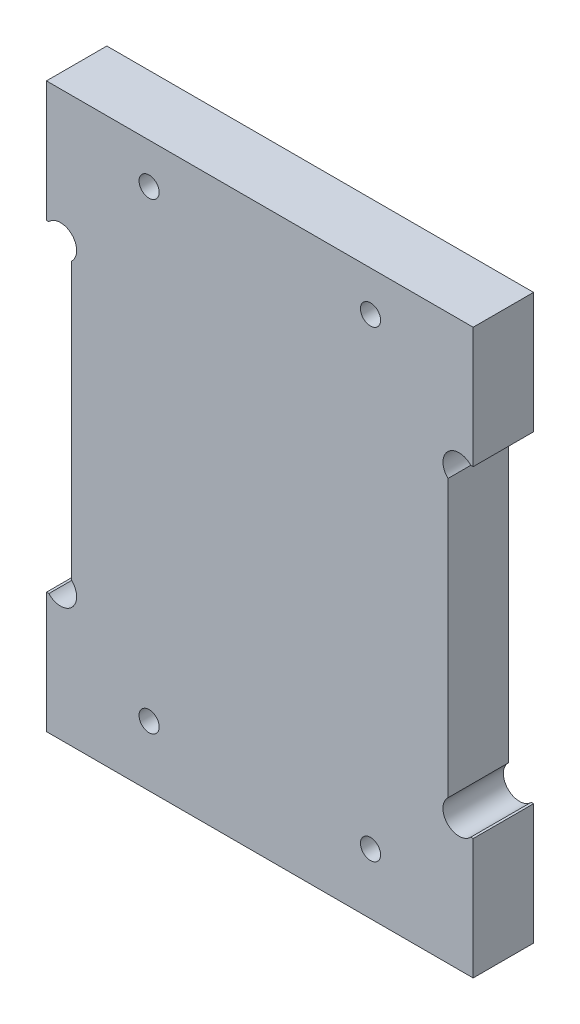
from build123d import *

# Parameters (mm, degrees)
ESQUISSE1_R             = 1
BOSS_EXTRU_1_DEPTH      = 6
ESQUISSE2_W             = 38.444349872
ESQUISSE2_H             = 80.070301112
ESQUISSE2_W_2           = 28.899545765
ESQUISSE2_H_2           = 80.070301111
ENL_V_MAT_EXTRU_1_DEPTH = 10


with BuildPart() as part:
    # Esquisse1 → Boss.-Extru.1 (new body)
    with BuildSketch(Plane.XY):
        with BuildLine():
            Line((-24.7, 27), (24.7, 27))
            Line((24.7, 27), (24.7, 15))
            Line((24.7, 15), (20.961895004, 15))
            ThreePointArc((20.961895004, 15), (18.66862915, 15.03137085), (18.7, 12.738104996))
            Line((18.7, 12.738104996), (18.7, -14.738104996))
            ThreePointArc((18.7, -14.738104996), (18.66862915, -17.03137085), (20.961895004, -17))
            Line((20.961895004, -17), (24.7, -17))
            Line((24.7, -17), (24.7, -29))
            Line((24.7, -29), (-24.7, -29))
            Line((-24.7, -29), (-24.7, -17))
            Line((-24.7, -17), (-20.961895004, -17))
            ThreePointArc((-20.961895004, -17), (-18.66862915, -17.03137085), (-18.7, -14.738104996))
            Line((-18.7, -14.738104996), (-18.7, 12.738104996))
            ThreePointArc((-18.7, 12.738104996), (-18.66862915, 15.03137085), (-20.961895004, 15))
            Line((-20.961895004, 15), (-24.7, 15))
            Line((-24.7, 15), (-24.7, 27))
        make_face()
        with Locations((-11, 23)):
            Circle(ESQUISSE1_R, mode=Mode.SUBTRACT)
        with Locations(Location((11, 23, 0), (0, 0, 180))):
            Circle(ESQUISSE1_R, mode=Mode.SUBTRACT)
        with Locations(Location((-11, -23, 0), (0, 0, 180))):
            Circle(ESQUISSE1_R, mode=Mode.SUBTRACT)
        with Locations((11, -23)):
            Circle(ESQUISSE1_R, mode=Mode.SUBTRACT)
    extrude(amount=BOSS_EXTRU_1_DEPTH)

    # Esquisse2 → Enl_v. mat.-Extru.1 (cut)
    with BuildSketch(Plane.XY.offset(6)):
        with Locations((40.422174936, 0.248710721)):
            Rectangle(ESQUISSE2_W, ESQUISSE2_H)
        with Locations((-35.649772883, -1.20952324)):
            Rectangle(ESQUISSE2_W_2, ESQUISSE2_H_2)
    extrude(amount=-ENL_V_MAT_EXTRU_1_DEPTH, mode=Mode.SUBTRACT)


solid = part.part
